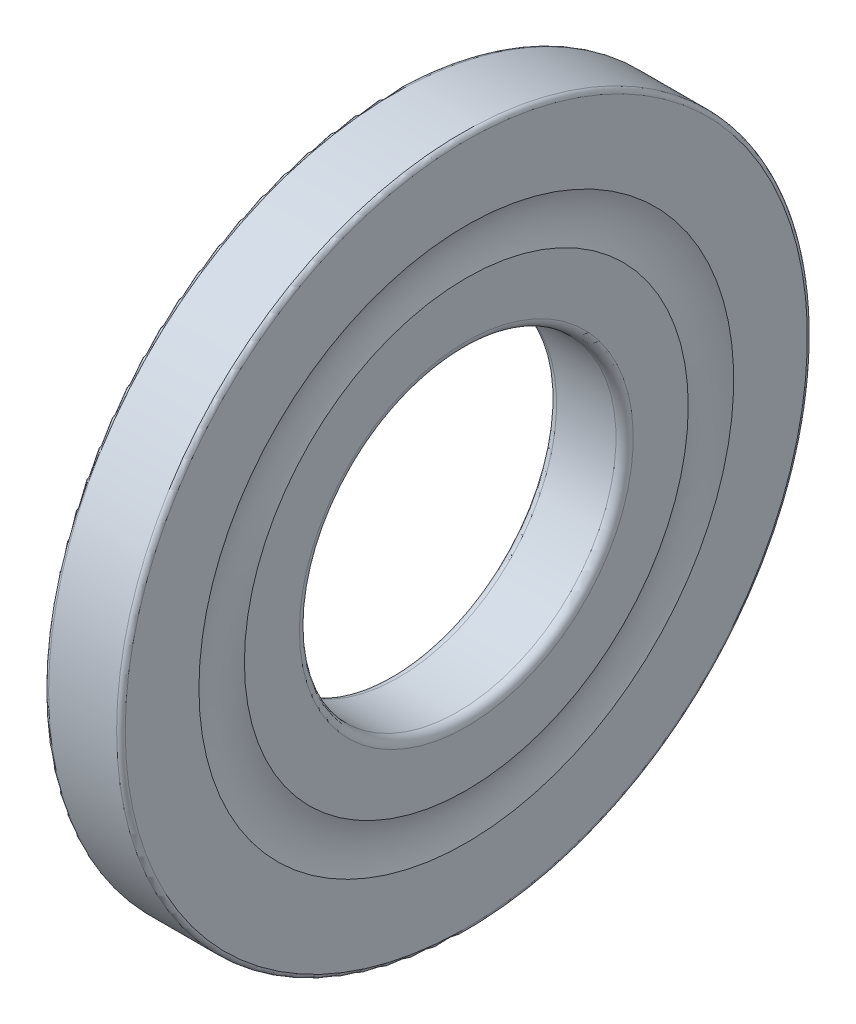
from build123d import *


with BuildPart() as part:
    # Esquisse1 → R_volution1 (revolve)
    with BuildSketch(Plane.XY, mode=Mode.PRIVATE) as r_volution1_sk:
        with BuildLine():
            Line((-1.8375, 9.289679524), (-1.8375, 11.85))
            ThreePointArc((-1.8375, 11.85), (-1.881433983, 11.956066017), (-1.9875, 12))
            Line((-1.9875, 12), (-4.35, 12))
            ThreePointArc((-4.35, 12), (-4.456066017, 11.956066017), (-4.5, 11.85))
            Line((-4.5, 11.85), (-4.5, 5.8))
            ThreePointArc((-4.5, 5.8), (-4.412132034, 5.587867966), (-4.2, 5.5))
            Line((-4.2, 5.5), (-2.1375, 5.5))
            ThreePointArc((-2.1375, 5.5), (-1.925367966, 5.587867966), (-1.8375, 5.8))
            Line((-1.8375, 5.8), (-1.8375, 7.710320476))
            ThreePointArc((-1.8375, 7.710320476), (-2, 8.5), (-1.8375, 9.289679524))
        make_face()
    revolve(r_volution1_sk.sketch.rotate(Axis((-4.5, 0, 0), (1, 0, 0)), 90), axis=Axis((-4.5, 0, 0), (1, 0, 0)))


solid = part.part
